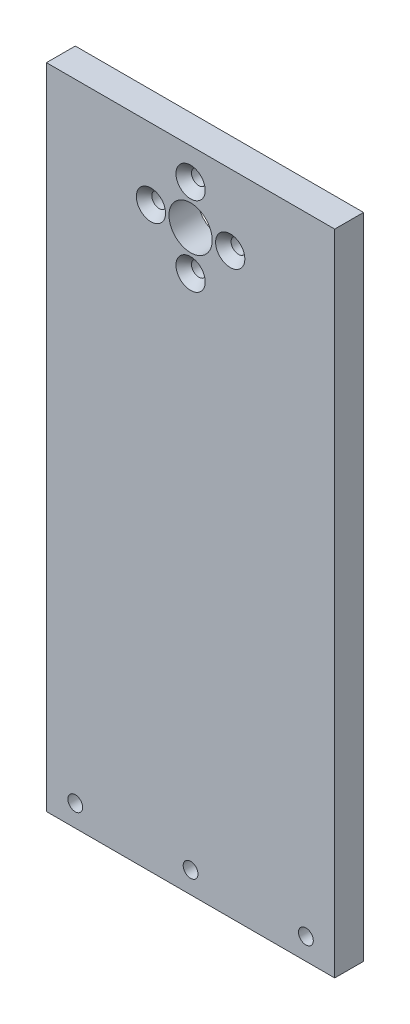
ISO-10303-21;
HEADER;
FILE_DESCRIPTION(('STEP AP214'),'2;1');
FILE_NAME('part.step','',(''),(''),'','','');
FILE_SCHEMA(('AUTOMOTIVE_DESIGN { 1 0 10303 214 1 1 1 1 }'));
ENDSEC;
DATA;
#1=APPLICATION_CONTEXT('core data for automotive mechanical design processes');
#2=APPLICATION_PROTOCOL_DEFINITION('international standard','automotive_design',2000,#1);
#3=PRODUCT_CONTEXT('',#1,'mechanical');
#4=PRODUCT('Part','Part','',(#3));
#5=PRODUCT_RELATED_PRODUCT_CATEGORY('part','',(#4));
#6=PRODUCT_DEFINITION_FORMATION('','',#4);
#7=PRODUCT_DEFINITION_CONTEXT('part definition',#1,'design');
#8=PRODUCT_DEFINITION('design','',#6,#7);
#9=PRODUCT_DEFINITION_SHAPE('','',#8);
#10=(LENGTH_UNIT() NAMED_UNIT(*) SI_UNIT(.MILLI.,.METRE.));
#11=(NAMED_UNIT(*) PLANE_ANGLE_UNIT() SI_UNIT($,.RADIAN.));
#12=(NAMED_UNIT(*) SI_UNIT($,.STERADIAN.) SOLID_ANGLE_UNIT());
#13=UNCERTAINTY_MEASURE_WITH_UNIT(LENGTH_MEASURE(1.E-05),#10,'distance_accuracy_value','');
#14=(GEOMETRIC_REPRESENTATION_CONTEXT(3) GLOBAL_UNCERTAINTY_ASSIGNED_CONTEXT((#13)) GLOBAL_UNIT_ASSIGNED_CONTEXT((#10,
#11,#12)) REPRESENTATION_CONTEXT('',''));
#15=CARTESIAN_POINT('',(0.,0.,0.));
#16=DIRECTION('',(0.,0.,1.));
#17=DIRECTION('',(1.,0.,0.));
#18=AXIS2_PLACEMENT_3D('',#15,#16,#17);
#19=CARTESIAN_POINT('',(-63.5,31.242,12.7));
#20=DIRECTION('',(1.,0.,0.));
#21=DIRECTION('',(0.,1.,0.));
#22=AXIS2_PLACEMENT_3D('',#19,#20,#21);
#23=PLANE('',#22);
#24=DIRECTION('',(0.,-1.,0.));
#25=VECTOR('',#24,1.);
#26=CARTESIAN_POINT('',(-63.5,31.242,0.));
#27=LINE('',#26,#25);
#28=CARTESIAN_POINT('',(-63.5,31.242,0.));
#29=VERTEX_POINT('',#28);
#30=CARTESIAN_POINT('',(-63.5,-254.508,0.));
#31=VERTEX_POINT('',#30);
#32=EDGE_CURVE('E98',#29,#31,#27,.T.);
#33=ORIENTED_EDGE('',*,*,#32,.T.);
#34=DIRECTION('',(0.,0.,-1.));
#35=VECTOR('',#34,1.);
#36=CARTESIAN_POINT('',(-63.5,-254.508,12.7));
#37=LINE('',#36,#35);
#38=CARTESIAN_POINT('',(-63.5,-254.508,12.7));
#39=VERTEX_POINT('',#38);
#40=EDGE_CURVE('E11',#39,#31,#37,.T.);
#41=ORIENTED_EDGE('',*,*,#40,.F.);
#42=DIRECTION('',(0.,-1.,0.));
#43=VECTOR('',#42,1.);
#44=CARTESIAN_POINT('',(-63.5,31.242,12.7));
#45=LINE('',#44,#43);
#46=CARTESIAN_POINT('',(-63.5,31.242,12.7));
#47=VERTEX_POINT('',#46);
#48=EDGE_CURVE('E86',#47,#39,#45,.T.);
#49=ORIENTED_EDGE('',*,*,#48,.F.);
#50=DIRECTION('',(0.,0.,-1.));
#51=VECTOR('',#50,1.);
#52=CARTESIAN_POINT('',(-63.5,31.242,12.7));
#53=LINE('',#52,#51);
#54=EDGE_CURVE('E94',#47,#29,#53,.T.);
#55=ORIENTED_EDGE('',*,*,#54,.T.);
#56=EDGE_LOOP('',(#33,#41,#49,#55));
#57=FACE_BOUND('',#56,.T.);
#58=ADVANCED_FACE('F35',(#57),#23,.F.);
#59=CARTESIAN_POINT('',(-63.5,-254.508,12.7));
#60=DIRECTION('',(0.,1.,0.));
#61=DIRECTION('',(0.,0.,1.));
#62=AXIS2_PLACEMENT_3D('',#59,#60,#61);
#63=PLANE('',#62);
#64=DIRECTION('',(1.,0.,0.));
#65=VECTOR('',#64,1.);
#66=CARTESIAN_POINT('',(-63.5,-254.508,0.));
#67=LINE('',#66,#65);
#68=CARTESIAN_POINT('',(63.5,-254.508,0.));
#69=VERTEX_POINT('',#68);
#70=EDGE_CURVE('E90',#31,#69,#67,.T.);
#71=ORIENTED_EDGE('',*,*,#70,.T.);
#72=DIRECTION('',(0.,0.,-1.));
#73=VECTOR('',#72,1.);
#74=CARTESIAN_POINT('',(63.5,-254.508,12.7));
#75=LINE('',#74,#73);
#76=CARTESIAN_POINT('',(63.5,-254.508,12.7));
#77=VERTEX_POINT('',#76);
#78=EDGE_CURVE('E43',#77,#69,#75,.T.);
#79=ORIENTED_EDGE('',*,*,#78,.F.);
#80=DIRECTION('',(1.,0.,0.));
#81=VECTOR('',#80,1.);
#82=CARTESIAN_POINT('',(-63.5,-254.508,12.7));
#83=LINE('',#82,#81);
#84=EDGE_CURVE('E81',#39,#77,#83,.T.);
#85=ORIENTED_EDGE('',*,*,#84,.F.);
#86=ORIENTED_EDGE('',*,*,#40,.T.);
#87=EDGE_LOOP('',(#71,#79,#85,#86));
#88=FACE_BOUND('',#87,.T.);
#89=ADVANCED_FACE('F89',(#88),#63,.F.);
#90=CARTESIAN_POINT('',(63.5,31.242,12.7));
#91=DIRECTION('',(-1.,0.,0.));
#92=DIRECTION('',(0.,-1.,0.));
#93=AXIS2_PLACEMENT_3D('',#90,#91,#92);
#94=PLANE('',#93);
#95=DIRECTION('',(0.,1.,0.));
#96=VECTOR('',#95,1.);
#97=CARTESIAN_POINT('',(63.5,31.242,0.));
#98=LINE('',#97,#96);
#99=CARTESIAN_POINT('',(63.5,31.242,0.));
#100=VERTEX_POINT('',#99);
#101=EDGE_CURVE('E68',#69,#100,#98,.T.);
#102=ORIENTED_EDGE('',*,*,#101,.T.);
#103=DIRECTION('',(0.,0.,-1.));
#104=VECTOR('',#103,1.);
#105=CARTESIAN_POINT('',(63.5,31.242,12.7));
#106=LINE('',#105,#104);
#107=CARTESIAN_POINT('',(63.5,31.242,12.7));
#108=VERTEX_POINT('',#107);
#109=EDGE_CURVE('E91',#108,#100,#106,.T.);
#110=ORIENTED_EDGE('',*,*,#109,.F.);
#111=DIRECTION('',(0.,1.,0.));
#112=VECTOR('',#111,1.);
#113=CARTESIAN_POINT('',(63.5,31.242,12.7));
#114=LINE('',#113,#112);
#115=EDGE_CURVE('E84',#77,#108,#114,.T.);
#116=ORIENTED_EDGE('',*,*,#115,.F.);
#117=ORIENTED_EDGE('',*,*,#78,.T.);
#118=EDGE_LOOP('',(#102,#110,#116,#117));
#119=FACE_BOUND('',#118,.T.);
#120=ADVANCED_FACE('F92',(#119),#94,.F.);
#121=CARTESIAN_POINT('',(-63.5,31.242,12.7));
#122=DIRECTION('',(0.,-1.,0.));
#123=DIRECTION('',(0.,0.,-1.));
#124=AXIS2_PLACEMENT_3D('',#121,#122,#123);
#125=PLANE('',#124);
#126=DIRECTION('',(-1.,0.,0.));
#127=VECTOR('',#126,1.);
#128=CARTESIAN_POINT('',(-63.5,31.242,0.));
#129=LINE('',#128,#127);
#130=EDGE_CURVE('E74',#100,#29,#129,.T.);
#131=ORIENTED_EDGE('',*,*,#130,.T.);
#132=ORIENTED_EDGE('',*,*,#54,.F.);
#133=DIRECTION('',(-1.,0.,0.));
#134=VECTOR('',#133,1.);
#135=CARTESIAN_POINT('',(-63.5,31.242,12.7));
#136=LINE('',#135,#134);
#137=EDGE_CURVE('E51',#108,#47,#136,.T.);
#138=ORIENTED_EDGE('',*,*,#137,.F.);
#139=ORIENTED_EDGE('',*,*,#109,.T.);
#140=EDGE_LOOP('',(#131,#132,#138,#139));
#141=FACE_BOUND('',#140,.T.);
#142=ADVANCED_FACE('F106',(#141),#125,.F.);
#143=CARTESIAN_POINT('',(0.,0.,12.7));
#144=DIRECTION('',(0.,0.,1.));
#145=DIRECTION('',(1.,0.,0.));
#146=AXIS2_PLACEMENT_3D('',#143,#144,#145);
#147=PLANE('',#146);
#148=CARTESIAN_POINT('',(-50.8,-244.983,12.7));
#149=DIRECTION('',(0.,0.,-1.));
#150=DIRECTION('',(-1.,0.,0.));
#151=AXIS2_PLACEMENT_3D('',#148,#149,#150);
#152=CIRCLE('',#151,3.2639);
#153=CARTESIAN_POINT('',(-54.0639,-244.983,12.7));
#154=VERTEX_POINT('',#153);
#155=EDGE_CURVE('E177',#154,#154,#152,.T.);
#156=ORIENTED_EDGE('',*,*,#155,.T.);
#157=EDGE_LOOP('',(#156));
#158=FACE_BOUND('',#157,.T.);
#159=CARTESIAN_POINT('',(0.,-244.983,12.7));
#160=DIRECTION('',(0.,0.,-1.));
#161=DIRECTION('',(-1.,0.,0.));
#162=AXIS2_PLACEMENT_3D('',#159,#160,#161);
#163=CIRCLE('',#162,3.2639);
#164=CARTESIAN_POINT('',(-3.2639,-244.983,12.7));
#165=VERTEX_POINT('',#164);
#166=EDGE_CURVE('E165',#165,#165,#163,.T.);
#167=ORIENTED_EDGE('',*,*,#166,.T.);
#168=EDGE_LOOP('',(#167));
#169=FACE_BOUND('',#168,.T.);
#170=CARTESIAN_POINT('',(50.8,-244.983,12.7));
#171=DIRECTION('',(0.,0.,-1.));
#172=DIRECTION('',(-1.,0.,0.));
#173=AXIS2_PLACEMENT_3D('',#170,#171,#172);
#174=CIRCLE('',#173,3.2639);
#175=CARTESIAN_POINT('',(47.5361,-244.983,12.7));
#176=VERTEX_POINT('',#175);
#177=EDGE_CURVE('E153',#176,#176,#174,.T.);
#178=ORIENTED_EDGE('',*,*,#177,.T.);
#179=EDGE_LOOP('',(#178));
#180=FACE_BOUND('',#179,.T.);
#181=CARTESIAN_POINT('',(-17.4625,0.,12.7));
#182=DIRECTION('',(0.,0.,1.));
#183=DIRECTION('',(1.,0.,0.));
#184=AXIS2_PLACEMENT_3D('',#181,#182,#183);
#185=CIRCLE('',#184,6.4389);
#186=CARTESIAN_POINT('',(-11.0236,0.,12.7));
#187=VERTEX_POINT('',#186);
#188=EDGE_CURVE('E150',#187,#187,#185,.T.);
#189=ORIENTED_EDGE('',*,*,#188,.F.);
#190=EDGE_LOOP('',(#189));
#191=FACE_BOUND('',#190,.T.);
#192=CARTESIAN_POINT('',(0.,17.4625,12.7));
#193=DIRECTION('',(0.,0.,1.));
#194=DIRECTION('',(1.,0.,0.));
#195=AXIS2_PLACEMENT_3D('',#192,#193,#194);
#196=CIRCLE('',#195,6.4389);
#197=CARTESIAN_POINT('',(6.4389,17.4625,12.7));
#198=VERTEX_POINT('',#197);
#199=EDGE_CURVE('E141',#198,#198,#196,.T.);
#200=ORIENTED_EDGE('',*,*,#199,.F.);
#201=EDGE_LOOP('',(#200));
#202=FACE_BOUND('',#201,.T.);
#203=CARTESIAN_POINT('',(17.4625,0.,12.7));
#204=DIRECTION('',(0.,0.,1.));
#205=DIRECTION('',(1.,0.,0.));
#206=AXIS2_PLACEMENT_3D('',#203,#204,#205);
#207=CIRCLE('',#206,6.4389);
#208=CARTESIAN_POINT('',(23.9014,0.,12.7));
#209=VERTEX_POINT('',#208);
#210=EDGE_CURVE('E132',#209,#209,#207,.T.);
#211=ORIENTED_EDGE('',*,*,#210,.F.);
#212=EDGE_LOOP('',(#211));
#213=FACE_BOUND('',#212,.T.);
#214=CARTESIAN_POINT('',(0.,-17.4625,12.7));
#215=DIRECTION('',(0.,0.,1.));
#216=DIRECTION('',(1.,0.,0.));
#217=AXIS2_PLACEMENT_3D('',#214,#215,#216);
#218=CIRCLE('',#217,6.4389);
#219=CARTESIAN_POINT('',(6.4389,-17.4625,12.7));
#220=VERTEX_POINT('',#219);
#221=EDGE_CURVE('E123',#220,#220,#218,.T.);
#222=ORIENTED_EDGE('',*,*,#221,.F.);
#223=EDGE_LOOP('',(#222));
#224=FACE_BOUND('',#223,.T.);
#225=CARTESIAN_POINT('',(0.,0.,12.7));
#226=DIRECTION('',(0.,0.,1.));
#227=DIRECTION('',(1.,0.,0.));
#228=AXIS2_PLACEMENT_3D('',#225,#226,#227);
#229=CIRCLE('',#228,9.525);
#230=CARTESIAN_POINT('',(9.525,0.,12.7));
#231=VERTEX_POINT('',#230);
#232=EDGE_CURVE('E114',#231,#231,#229,.T.);
#233=ORIENTED_EDGE('',*,*,#232,.F.);
#234=EDGE_LOOP('',(#233));
#235=FACE_BOUND('',#234,.T.);
#236=ORIENTED_EDGE('',*,*,#48,.T.);
#237=ORIENTED_EDGE('',*,*,#84,.T.);
#238=ORIENTED_EDGE('',*,*,#115,.T.);
#239=ORIENTED_EDGE('',*,*,#137,.T.);
#240=EDGE_LOOP('',(#236,#237,#238,#239));
#241=FACE_BOUND('',#240,.T.);
#242=ADVANCED_FACE('F82',(#158,#169,#180,#191,#202,#213,#224,#235,#241),#147,.T.);
#243=CARTESIAN_POINT('',(0.,0.,0.));
#244=DIRECTION('',(0.,0.,1.));
#245=DIRECTION('',(1.,0.,0.));
#246=AXIS2_PLACEMENT_3D('',#243,#244,#245);
#247=PLANE('',#246);
#248=CARTESIAN_POINT('',(-50.8,-244.983,0.));
#249=DIRECTION('',(0.,0.,-1.));
#250=DIRECTION('',(-1.,0.,0.));
#251=AXIS2_PLACEMENT_3D('',#248,#249,#250);
#252=CIRCLE('',#251,5.55625);
#253=CARTESIAN_POINT('',(-56.35625,-244.983,0.));
#254=VERTEX_POINT('',#253);
#255=EDGE_CURVE('E186',#254,#254,#252,.T.);
#256=ORIENTED_EDGE('',*,*,#255,.F.);
#257=EDGE_LOOP('',(#256));
#258=FACE_BOUND('',#257,.T.);
#259=CARTESIAN_POINT('',(0.,-244.983,0.));
#260=DIRECTION('',(0.,0.,-1.));
#261=DIRECTION('',(-1.,0.,0.));
#262=AXIS2_PLACEMENT_3D('',#259,#260,#261);
#263=CIRCLE('',#262,5.55625);
#264=CARTESIAN_POINT('',(-5.55625,-244.983,0.));
#265=VERTEX_POINT('',#264);
#266=EDGE_CURVE('E174',#265,#265,#263,.T.);
#267=ORIENTED_EDGE('',*,*,#266,.F.);
#268=EDGE_LOOP('',(#267));
#269=FACE_BOUND('',#268,.T.);
#270=CARTESIAN_POINT('',(50.8,-244.983,0.));
#271=DIRECTION('',(0.,0.,-1.));
#272=DIRECTION('',(-1.,0.,0.));
#273=AXIS2_PLACEMENT_3D('',#270,#271,#272);
#274=CIRCLE('',#273,5.55625);
#275=CARTESIAN_POINT('',(45.24375,-244.983,0.));
#276=VERTEX_POINT('',#275);
#277=EDGE_CURVE('E162',#276,#276,#274,.T.);
#278=ORIENTED_EDGE('',*,*,#277,.F.);
#279=EDGE_LOOP('',(#278));
#280=FACE_BOUND('',#279,.T.);
#281=CARTESIAN_POINT('',(-17.4625,0.,0.));
#282=DIRECTION('',(0.,0.,1.));
#283=DIRECTION('',(1.,0.,0.));
#284=AXIS2_PLACEMENT_3D('',#281,#282,#283);
#285=CIRCLE('',#284,3.2639);
#286=CARTESIAN_POINT('',(-14.1986,0.,0.));
#287=VERTEX_POINT('',#286);
#288=EDGE_CURVE('E144',#287,#287,#285,.T.);
#289=ORIENTED_EDGE('',*,*,#288,.T.);
#290=EDGE_LOOP('',(#289));
#291=FACE_BOUND('',#290,.T.);
#292=CARTESIAN_POINT('',(0.,17.4625,0.));
#293=DIRECTION('',(0.,0.,1.));
#294=DIRECTION('',(1.,0.,0.));
#295=AXIS2_PLACEMENT_3D('',#292,#293,#294);
#296=CIRCLE('',#295,3.2639);
#297=CARTESIAN_POINT('',(3.2639,17.4625,0.));
#298=VERTEX_POINT('',#297);
#299=EDGE_CURVE('E135',#298,#298,#296,.T.);
#300=ORIENTED_EDGE('',*,*,#299,.T.);
#301=EDGE_LOOP('',(#300));
#302=FACE_BOUND('',#301,.T.);
#303=CARTESIAN_POINT('',(17.4625,0.,0.));
#304=DIRECTION('',(0.,0.,1.));
#305=DIRECTION('',(1.,0.,0.));
#306=AXIS2_PLACEMENT_3D('',#303,#304,#305);
#307=CIRCLE('',#306,3.2639);
#308=CARTESIAN_POINT('',(20.7264,0.,0.));
#309=VERTEX_POINT('',#308);
#310=EDGE_CURVE('E126',#309,#309,#307,.T.);
#311=ORIENTED_EDGE('',*,*,#310,.T.);
#312=EDGE_LOOP('',(#311));
#313=FACE_BOUND('',#312,.T.);
#314=CARTESIAN_POINT('',(0.,-17.4625,0.));
#315=DIRECTION('',(0.,0.,1.));
#316=DIRECTION('',(1.,0.,0.));
#317=AXIS2_PLACEMENT_3D('',#314,#315,#316);
#318=CIRCLE('',#317,3.2639);
#319=CARTESIAN_POINT('',(3.26389999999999,-17.4625,0.));
#320=VERTEX_POINT('',#319);
#321=EDGE_CURVE('E117',#320,#320,#318,.T.);
#322=ORIENTED_EDGE('',*,*,#321,.T.);
#323=EDGE_LOOP('',(#322));
#324=FACE_BOUND('',#323,.T.);
#325=CARTESIAN_POINT('',(0.,0.,0.));
#326=DIRECTION('',(0.,0.,1.));
#327=DIRECTION('',(1.,0.,0.));
#328=AXIS2_PLACEMENT_3D('',#325,#326,#327);
#329=CIRCLE('',#328,9.525);
#330=CARTESIAN_POINT('',(9.525,0.,0.));
#331=VERTEX_POINT('',#330);
#332=EDGE_CURVE('E101',#331,#331,#329,.T.);
#333=ORIENTED_EDGE('',*,*,#332,.T.);
#334=EDGE_LOOP('',(#333));
#335=FACE_BOUND('',#334,.T.);
#336=ORIENTED_EDGE('',*,*,#32,.F.);
#337=ORIENTED_EDGE('',*,*,#130,.F.);
#338=ORIENTED_EDGE('',*,*,#101,.F.);
#339=ORIENTED_EDGE('',*,*,#70,.F.);
#340=EDGE_LOOP('',(#336,#337,#338,#339));
#341=FACE_BOUND('',#340,.T.);
#342=ADVANCED_FACE('F109',(#258,#269,#280,#291,#302,#313,#324,#335,#341),#247,.F.);
#343=CARTESIAN_POINT('',(0.,0.,12.7));
#344=DIRECTION('',(0.,0.,1.));
#345=DIRECTION('',(1.,0.,0.));
#346=AXIS2_PLACEMENT_3D('',#343,#344,#345);
#347=CYLINDRICAL_SURFACE('',#346,9.525);
#348=ORIENTED_EDGE('',*,*,#332,.F.);
#349=EDGE_LOOP('',(#348));
#350=FACE_BOUND('',#349,.T.);
#351=ORIENTED_EDGE('',*,*,#232,.T.);
#352=EDGE_LOOP('',(#351));
#353=FACE_BOUND('',#352,.T.);
#354=ADVANCED_FACE('F194',(#350,#353),#347,.F.);
#355=CARTESIAN_POINT('',(0.,-17.4625,12.7));
#356=DIRECTION('',(0.,0.,1.));
#357=DIRECTION('',(1.,0.,0.));
#358=AXIS2_PLACEMENT_3D('',#355,#356,#357);
#359=CYLINDRICAL_SURFACE('',#358,3.2639);
#360=ORIENTED_EDGE('',*,*,#321,.F.);
#361=EDGE_LOOP('',(#360));
#362=FACE_BOUND('',#361,.T.);
#363=CARTESIAN_POINT('',(0.,-17.4625,9.04758030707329));
#364=DIRECTION('',(0.,0.,1.));
#365=DIRECTION('',(1.,0.,0.));
#366=AXIS2_PLACEMENT_3D('',#363,#364,#365);
#367=CIRCLE('',#366,3.2639);
#368=CARTESIAN_POINT('',(3.26389999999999,-17.4625,9.04758030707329));
#369=VERTEX_POINT('',#368);
#370=EDGE_CURVE('E120',#369,#369,#367,.T.);
#371=ORIENTED_EDGE('',*,*,#370,.T.);
#372=EDGE_LOOP('',(#371));
#373=FACE_BOUND('',#372,.T.);
#374=ADVANCED_FACE('F212',(#362,#373),#359,.F.);
#375=CARTESIAN_POINT('',(0.,-17.4625,12.7));
#376=DIRECTION('',(0.,0.,1.));
#377=DIRECTION('',(1.,0.,0.));
#378=AXIS2_PLACEMENT_3D('',#375,#376,#377);
#379=CONICAL_SURFACE('',#378,6.4389,0.715584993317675);
#380=ORIENTED_EDGE('',*,*,#370,.F.);
#381=EDGE_LOOP('',(#380));
#382=FACE_BOUND('',#381,.T.);
#383=ORIENTED_EDGE('',*,*,#221,.T.);
#384=EDGE_LOOP('',(#383));
#385=FACE_BOUND('',#384,.T.);
#386=ADVANCED_FACE('F255',(#382,#385),#379,.F.);
#387=CARTESIAN_POINT('',(17.4625,0.,12.7));
#388=DIRECTION('',(0.,0.,1.));
#389=DIRECTION('',(1.,0.,0.));
#390=AXIS2_PLACEMENT_3D('',#387,#388,#389);
#391=CYLINDRICAL_SURFACE('',#390,3.2639);
#392=ORIENTED_EDGE('',*,*,#310,.F.);
#393=EDGE_LOOP('',(#392));
#394=FACE_BOUND('',#393,.T.);
#395=CARTESIAN_POINT('',(17.4625,0.,9.04758030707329));
#396=DIRECTION('',(0.,0.,1.));
#397=DIRECTION('',(1.,0.,0.));
#398=AXIS2_PLACEMENT_3D('',#395,#396,#397);
#399=CIRCLE('',#398,3.2639);
#400=CARTESIAN_POINT('',(20.7264,0.,9.04758030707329));
#401=VERTEX_POINT('',#400);
#402=EDGE_CURVE('E129',#401,#401,#399,.T.);
#403=ORIENTED_EDGE('',*,*,#402,.T.);
#404=EDGE_LOOP('',(#403));
#405=FACE_BOUND('',#404,.T.);
#406=ADVANCED_FACE('F265',(#394,#405),#391,.F.);
#407=CARTESIAN_POINT('',(17.4625,0.,12.7));
#408=DIRECTION('',(0.,0.,1.));
#409=DIRECTION('',(1.,0.,0.));
#410=AXIS2_PLACEMENT_3D('',#407,#408,#409);
#411=CONICAL_SURFACE('',#410,6.4389,0.715584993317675);
#412=ORIENTED_EDGE('',*,*,#402,.F.);
#413=EDGE_LOOP('',(#412));
#414=FACE_BOUND('',#413,.T.);
#415=ORIENTED_EDGE('',*,*,#210,.T.);
#416=EDGE_LOOP('',(#415));
#417=FACE_BOUND('',#416,.T.);
#418=ADVANCED_FACE('F275',(#414,#417),#411,.F.);
#419=CARTESIAN_POINT('',(0.,17.4625,12.7));
#420=DIRECTION('',(0.,0.,1.));
#421=DIRECTION('',(1.,0.,0.));
#422=AXIS2_PLACEMENT_3D('',#419,#420,#421);
#423=CYLINDRICAL_SURFACE('',#422,3.2639);
#424=ORIENTED_EDGE('',*,*,#299,.F.);
#425=EDGE_LOOP('',(#424));
#426=FACE_BOUND('',#425,.T.);
#427=CARTESIAN_POINT('',(0.,17.4625,9.04758030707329));
#428=DIRECTION('',(0.,0.,1.));
#429=DIRECTION('',(1.,0.,0.));
#430=AXIS2_PLACEMENT_3D('',#427,#428,#429);
#431=CIRCLE('',#430,3.2639);
#432=CARTESIAN_POINT('',(3.2639,17.4625,9.04758030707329));
#433=VERTEX_POINT('',#432);
#434=EDGE_CURVE('E138',#433,#433,#431,.T.);
#435=ORIENTED_EDGE('',*,*,#434,.T.);
#436=EDGE_LOOP('',(#435));
#437=FACE_BOUND('',#436,.T.);
#438=ADVANCED_FACE('F285',(#426,#437),#423,.F.);
#439=CARTESIAN_POINT('',(0.,17.4625,12.7));
#440=DIRECTION('',(0.,0.,1.));
#441=DIRECTION('',(1.,0.,0.));
#442=AXIS2_PLACEMENT_3D('',#439,#440,#441);
#443=CONICAL_SURFACE('',#442,6.4389,0.715584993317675);
#444=ORIENTED_EDGE('',*,*,#434,.F.);
#445=EDGE_LOOP('',(#444));
#446=FACE_BOUND('',#445,.T.);
#447=ORIENTED_EDGE('',*,*,#199,.T.);
#448=EDGE_LOOP('',(#447));
#449=FACE_BOUND('',#448,.T.);
#450=ADVANCED_FACE('F295',(#446,#449),#443,.F.);
#451=CARTESIAN_POINT('',(-17.4625,0.,12.7));
#452=DIRECTION('',(0.,0.,1.));
#453=DIRECTION('',(1.,0.,0.));
#454=AXIS2_PLACEMENT_3D('',#451,#452,#453);
#455=CYLINDRICAL_SURFACE('',#454,3.2639);
#456=ORIENTED_EDGE('',*,*,#288,.F.);
#457=EDGE_LOOP('',(#456));
#458=FACE_BOUND('',#457,.T.);
#459=CARTESIAN_POINT('',(-17.4625,0.,9.04758030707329));
#460=DIRECTION('',(0.,0.,1.));
#461=DIRECTION('',(1.,0.,0.));
#462=AXIS2_PLACEMENT_3D('',#459,#460,#461);
#463=CIRCLE('',#462,3.2639);
#464=CARTESIAN_POINT('',(-14.1986,0.,9.04758030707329));
#465=VERTEX_POINT('',#464);
#466=EDGE_CURVE('E147',#465,#465,#463,.T.);
#467=ORIENTED_EDGE('',*,*,#466,.T.);
#468=EDGE_LOOP('',(#467));
#469=FACE_BOUND('',#468,.T.);
#470=ADVANCED_FACE('F305',(#458,#469),#455,.F.);
#471=CARTESIAN_POINT('',(-17.4625,0.,12.7));
#472=DIRECTION('',(0.,0.,1.));
#473=DIRECTION('',(1.,0.,0.));
#474=AXIS2_PLACEMENT_3D('',#471,#472,#473);
#475=CONICAL_SURFACE('',#474,6.4389,0.715584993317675);
#476=ORIENTED_EDGE('',*,*,#466,.F.);
#477=EDGE_LOOP('',(#476));
#478=FACE_BOUND('',#477,.T.);
#479=ORIENTED_EDGE('',*,*,#188,.T.);
#480=EDGE_LOOP('',(#479));
#481=FACE_BOUND('',#480,.T.);
#482=ADVANCED_FACE('F315',(#478,#481),#475,.F.);
#483=CARTESIAN_POINT('',(50.8,-244.983,0.));
#484=DIRECTION('',(0.,0.,-1.));
#485=DIRECTION('',(-1.,0.,0.));
#486=AXIS2_PLACEMENT_3D('',#483,#484,#485);
#487=CYLINDRICAL_SURFACE('',#486,3.2639);
#488=ORIENTED_EDGE('',*,*,#177,.F.);
#489=EDGE_LOOP('',(#488));
#490=FACE_BOUND('',#489,.T.);
#491=CARTESIAN_POINT('',(50.8,-244.983,6.35));
#492=DIRECTION('',(0.,0.,-1.));
#493=DIRECTION('',(-1.,0.,0.));
#494=AXIS2_PLACEMENT_3D('',#491,#492,#493);
#495=CIRCLE('',#494,3.2639);
#496=CARTESIAN_POINT('',(47.5361,-244.983,6.35));
#497=VERTEX_POINT('',#496);
#498=EDGE_CURVE('E156',#497,#497,#495,.T.);
#499=ORIENTED_EDGE('',*,*,#498,.T.);
#500=EDGE_LOOP('',(#499));
#501=FACE_BOUND('',#500,.T.);
#502=ADVANCED_FACE('F324',(#490,#501),#487,.F.);
#503=CARTESIAN_POINT('',(54.0639,-244.983,6.35));
#504=DIRECTION('',(0.,0.,1.));
#505=DIRECTION('',(1.,0.,0.));
#506=AXIS2_PLACEMENT_3D('',#503,#504,#505);
#507=PLANE('',#506);
#508=ORIENTED_EDGE('',*,*,#498,.F.);
#509=EDGE_LOOP('',(#508));
#510=FACE_BOUND('',#509,.T.);
#511=CARTESIAN_POINT('',(50.8,-244.983,6.35));
#512=DIRECTION('',(0.,0.,-1.));
#513=DIRECTION('',(-1.,0.,0.));
#514=AXIS2_PLACEMENT_3D('',#511,#512,#513);
#515=CIRCLE('',#514,5.55625);
#516=CARTESIAN_POINT('',(45.24375,-244.983,6.35));
#517=VERTEX_POINT('',#516);
#518=EDGE_CURVE('E159',#517,#517,#515,.T.);
#519=ORIENTED_EDGE('',*,*,#518,.T.);
#520=EDGE_LOOP('',(#519));
#521=FACE_BOUND('',#520,.T.);
#522=ADVANCED_FACE('F343',(#510,#521),#507,.F.);
#523=CARTESIAN_POINT('',(50.8,-244.983,0.));
#524=DIRECTION('',(0.,0.,-1.));
#525=DIRECTION('',(-1.,0.,0.));
#526=AXIS2_PLACEMENT_3D('',#523,#524,#525);
#527=CYLINDRICAL_SURFACE('',#526,5.55625);
#528=ORIENTED_EDGE('',*,*,#518,.F.);
#529=EDGE_LOOP('',(#528));
#530=FACE_BOUND('',#529,.T.);
#531=ORIENTED_EDGE('',*,*,#277,.T.);
#532=EDGE_LOOP('',(#531));
#533=FACE_BOUND('',#532,.T.);
#534=ADVANCED_FACE('F353',(#530,#533),#527,.F.);
#535=CARTESIAN_POINT('',(0.,-244.983,0.));
#536=DIRECTION('',(0.,0.,-1.));
#537=DIRECTION('',(-1.,0.,0.));
#538=AXIS2_PLACEMENT_3D('',#535,#536,#537);
#539=CYLINDRICAL_SURFACE('',#538,3.2639);
#540=ORIENTED_EDGE('',*,*,#166,.F.);
#541=EDGE_LOOP('',(#540));
#542=FACE_BOUND('',#541,.T.);
#543=CARTESIAN_POINT('',(0.,-244.983,6.35));
#544=DIRECTION('',(0.,0.,-1.));
#545=DIRECTION('',(-1.,0.,0.));
#546=AXIS2_PLACEMENT_3D('',#543,#544,#545);
#547=CIRCLE('',#546,3.2639);
#548=CARTESIAN_POINT('',(-3.2639,-244.983,6.35));
#549=VERTEX_POINT('',#548);
#550=EDGE_CURVE('E168',#549,#549,#547,.T.);
#551=ORIENTED_EDGE('',*,*,#550,.T.);
#552=EDGE_LOOP('',(#551));
#553=FACE_BOUND('',#552,.T.);
#554=ADVANCED_FACE('F363',(#542,#553),#539,.F.);
#555=CARTESIAN_POINT('',(3.2639,-244.983,6.35));
#556=DIRECTION('',(0.,0.,1.));
#557=DIRECTION('',(1.,0.,0.));
#558=AXIS2_PLACEMENT_3D('',#555,#556,#557);
#559=PLANE('',#558);
#560=ORIENTED_EDGE('',*,*,#550,.F.);
#561=EDGE_LOOP('',(#560));
#562=FACE_BOUND('',#561,.T.);
#563=CARTESIAN_POINT('',(0.,-244.983,6.35));
#564=DIRECTION('',(0.,0.,-1.));
#565=DIRECTION('',(-1.,0.,0.));
#566=AXIS2_PLACEMENT_3D('',#563,#564,#565);
#567=CIRCLE('',#566,5.55625);
#568=CARTESIAN_POINT('',(-5.55625,-244.983,6.35));
#569=VERTEX_POINT('',#568);
#570=EDGE_CURVE('E171',#569,#569,#567,.T.);
#571=ORIENTED_EDGE('',*,*,#570,.T.);
#572=EDGE_LOOP('',(#571));
#573=FACE_BOUND('',#572,.T.);
#574=ADVANCED_FACE('F373',(#562,#573),#559,.F.);
#575=CARTESIAN_POINT('',(0.,-244.983,0.));
#576=DIRECTION('',(0.,0.,-1.));
#577=DIRECTION('',(-1.,0.,0.));
#578=AXIS2_PLACEMENT_3D('',#575,#576,#577);
#579=CYLINDRICAL_SURFACE('',#578,5.55625);
#580=ORIENTED_EDGE('',*,*,#570,.F.);
#581=EDGE_LOOP('',(#580));
#582=FACE_BOUND('',#581,.T.);
#583=ORIENTED_EDGE('',*,*,#266,.T.);
#584=EDGE_LOOP('',(#583));
#585=FACE_BOUND('',#584,.T.);
#586=ADVANCED_FACE('F383',(#582,#585),#579,.F.);
#587=CARTESIAN_POINT('',(-50.8,-244.983,0.));
#588=DIRECTION('',(0.,0.,-1.));
#589=DIRECTION('',(-1.,0.,0.));
#590=AXIS2_PLACEMENT_3D('',#587,#588,#589);
#591=CYLINDRICAL_SURFACE('',#590,3.2639);
#592=ORIENTED_EDGE('',*,*,#155,.F.);
#593=EDGE_LOOP('',(#592));
#594=FACE_BOUND('',#593,.T.);
#595=CARTESIAN_POINT('',(-50.8,-244.983,6.35));
#596=DIRECTION('',(0.,0.,-1.));
#597=DIRECTION('',(-1.,0.,0.));
#598=AXIS2_PLACEMENT_3D('',#595,#596,#597);
#599=CIRCLE('',#598,3.2639);
#600=CARTESIAN_POINT('',(-54.0639,-244.983,6.35));
#601=VERTEX_POINT('',#600);
#602=EDGE_CURVE('E180',#601,#601,#599,.T.);
#603=ORIENTED_EDGE('',*,*,#602,.T.);
#604=EDGE_LOOP('',(#603));
#605=FACE_BOUND('',#604,.T.);
#606=ADVANCED_FACE('F393',(#594,#605),#591,.F.);
#607=CARTESIAN_POINT('',(-47.5361,-244.983,6.35));
#608=DIRECTION('',(0.,0.,1.));
#609=DIRECTION('',(1.,0.,0.));
#610=AXIS2_PLACEMENT_3D('',#607,#608,#609);
#611=PLANE('',#610);
#612=ORIENTED_EDGE('',*,*,#602,.F.);
#613=EDGE_LOOP('',(#612));
#614=FACE_BOUND('',#613,.T.);
#615=CARTESIAN_POINT('',(-50.8,-244.983,6.35));
#616=DIRECTION('',(0.,0.,-1.));
#617=DIRECTION('',(-1.,0.,0.));
#618=AXIS2_PLACEMENT_3D('',#615,#616,#617);
#619=CIRCLE('',#618,5.55625);
#620=CARTESIAN_POINT('',(-56.35625,-244.983,6.35));
#621=VERTEX_POINT('',#620);
#622=EDGE_CURVE('E183',#621,#621,#619,.T.);
#623=ORIENTED_EDGE('',*,*,#622,.T.);
#624=EDGE_LOOP('',(#623));
#625=FACE_BOUND('',#624,.T.);
#626=ADVANCED_FACE('F403',(#614,#625),#611,.F.);
#627=CARTESIAN_POINT('',(-50.8,-244.983,0.));
#628=DIRECTION('',(0.,0.,-1.));
#629=DIRECTION('',(-1.,0.,0.));
#630=AXIS2_PLACEMENT_3D('',#627,#628,#629);
#631=CYLINDRICAL_SURFACE('',#630,5.55625);
#632=ORIENTED_EDGE('',*,*,#622,.F.);
#633=EDGE_LOOP('',(#632));
#634=FACE_BOUND('',#633,.T.);
#635=ORIENTED_EDGE('',*,*,#255,.T.);
#636=EDGE_LOOP('',(#635));
#637=FACE_BOUND('',#636,.T.);
#638=ADVANCED_FACE('F190',(#634,#637),#631,.F.);
#639=CLOSED_SHELL('',(#58,#89,#120,#142,#242,#342,#354,#374,#386,#406,#418,#438,#450,#470,#482,
#502,#522,#534,#554,#574,#586,#606,#626,#638));
#640=MANIFOLD_SOLID_BREP('B2',#639);
#641=ADVANCED_BREP_SHAPE_REPRESENTATION('',(#18,#640),#14);
#642=SHAPE_DEFINITION_REPRESENTATION(#9,#641);
ENDSEC;
END-ISO-10303-21;
